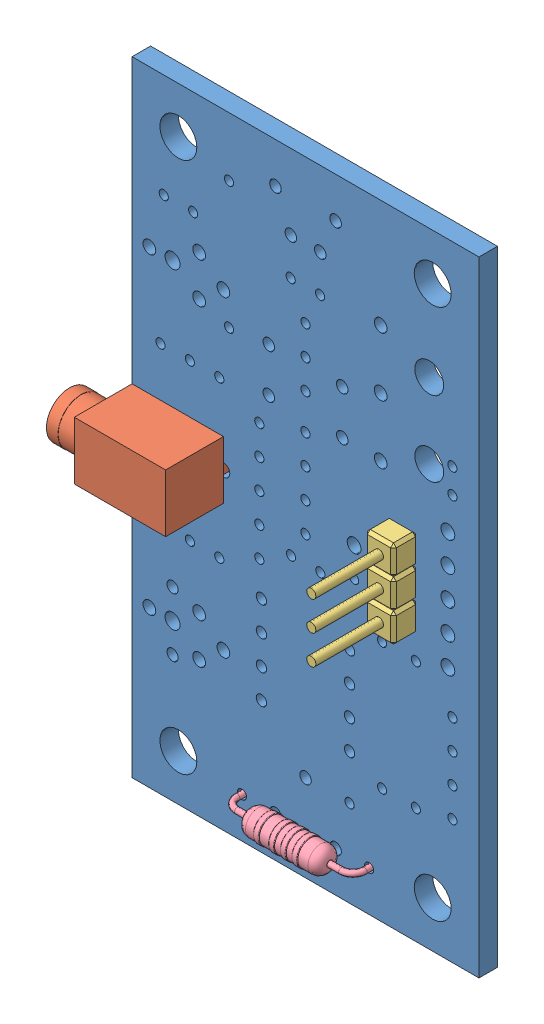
SolidWorks assembly K-AP-MOLED.SLDASM, configuration Défaut (file format 6000). Lengths in mm.
Overall size (32.91 54 11.01).
8 component instances, 4 part files, 6 mates.
Components (placement in the parent):
- CI AP-EIR avec embase-1: CI AP-EIR avec embase.SLDASM [Défaut] at (-2.9015 -0.264 0) size (32.91 54 8.01)
  - CI AP-EIR-1: CI AP-EIR.SLDPRT [Défaut] at (-19.5215 -26.5712 0) size (30 54 1.6)
  - Embase jack 2.5-1: Embase jack 2.5.SLDPRT [Défaut] at (-19.5215 0.429 1.6) x (1 0 0) z (0 -1 0) size (10.81 8.01 5)
- ASB 3PICOTS-1: ASB 3PICOTS.SLDASM [Default] at (1.743 2.5589 5.703) x (0 1 0) z (0 0 -1) size (7.59 2.51 10)
  - PICOT-1: PICOT.SLDPRT [Default] at (26.8516 -23.7306 1.953) size (2.51 2.51 10)
  - PICOT-2: PICOT.SLDPRT [Default] at (29.3916 -23.7306 1.953) size (2.51 2.51 10)
  - PICOT-3: PICOT.SLDPRT [Default] at (24.3116 -23.7306 1.953) size (2.51 2.51 10)
- Résistance 1 ohm pas 11-1: Résistance 1 ohm pas 11.SLDPRT [Défaut] at (-7.4233 -23.3351 3) x (1 0 0) z (0 -1 0) size (11.5 4.15 2.3)
Mates (geometry in assembly coordinates):
- Coïncidente3: coincident anti-aligned: axis of CI AP-EIR avec embase-1/CI AP-EIR-1 through (1.0772 -2.375 1.6) axis (0 0 -1); axis of ASB 3PICOTS-1/PICOT-3 through (1.0772 -2.375 -0.4) axis (0 0 1)
- Coïncidente4: coincident anti-aligned: axis of CI AP-EIR avec embase-1/CI AP-EIR-1 through (1.0772 0.165 1.6) axis (0 0 -1); axis of ASB 3PICOTS-1/PICOT-1 through (1.0772 0.165 -0.4) axis (0 0 1)
- Coïncidente5: coincident anti-aligned: plane of CI AP-EIR avec embase-1/CI AP-EIR-1 through (-22.4229 -26.8352 1.6) normal (0 0 1); plane of ASB 3PICOTS-1/PICOT-3 through (-0.1778 -3.63 1.6) normal (0 0 -1)
- Coïncidente6: coincident: axis of CI AP-EIR avec embase-1/CI AP-EIR-1 through (-1.9226 -23.3351 1.6) axis (0 0 -1); axis of Résistance 1 ohm pas 11-1 through (-1.9233 -23.3351 2) axis (0 0 -1)
- Coïncidente7: coincident: axis of CI AP-EIR avec embase-1/CI AP-EIR-1 through (-12.9233 -23.3351 1.6) axis (0 0 -1); axis of Résistance 1 ohm pas 11-1 through (-12.9233 -23.3351 2) axis (0 0 -1)
- Coïncidente8: coincident aligned: plane of CI AP-EIR avec embase-1/CI AP-EIR-1 through (-22.4229 -26.8352 0) normal (0 0 -1); plane of Résistance 1 ohm pas 11-1 through (-1.9233 -23.3351 0) normal (0 0 -1)
